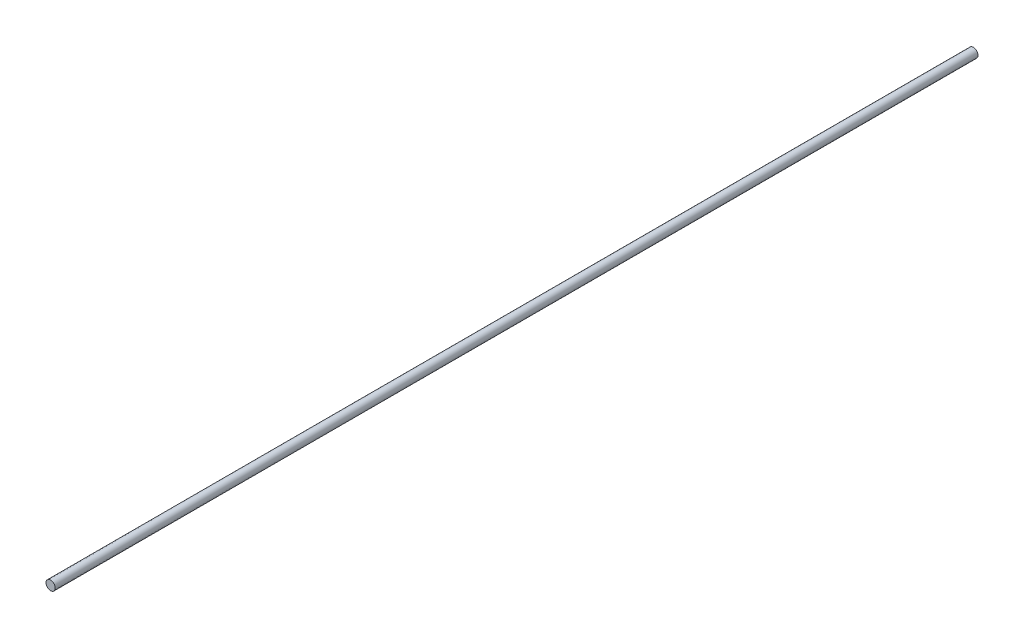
from build123d import *

# Parameters (mm, degrees)
PROFIL_R             = 0.25
AUFSATZ_LIN_GK_DEPTH = 50


with BuildPart() as part:
    # Profil → Aufsatz-Lin_GK (new body)
    with BuildSketch(Plane.XY):
        Circle(PROFIL_R)
    extrude(amount=AUFSATZ_LIN_GK_DEPTH)


solid = part.part
